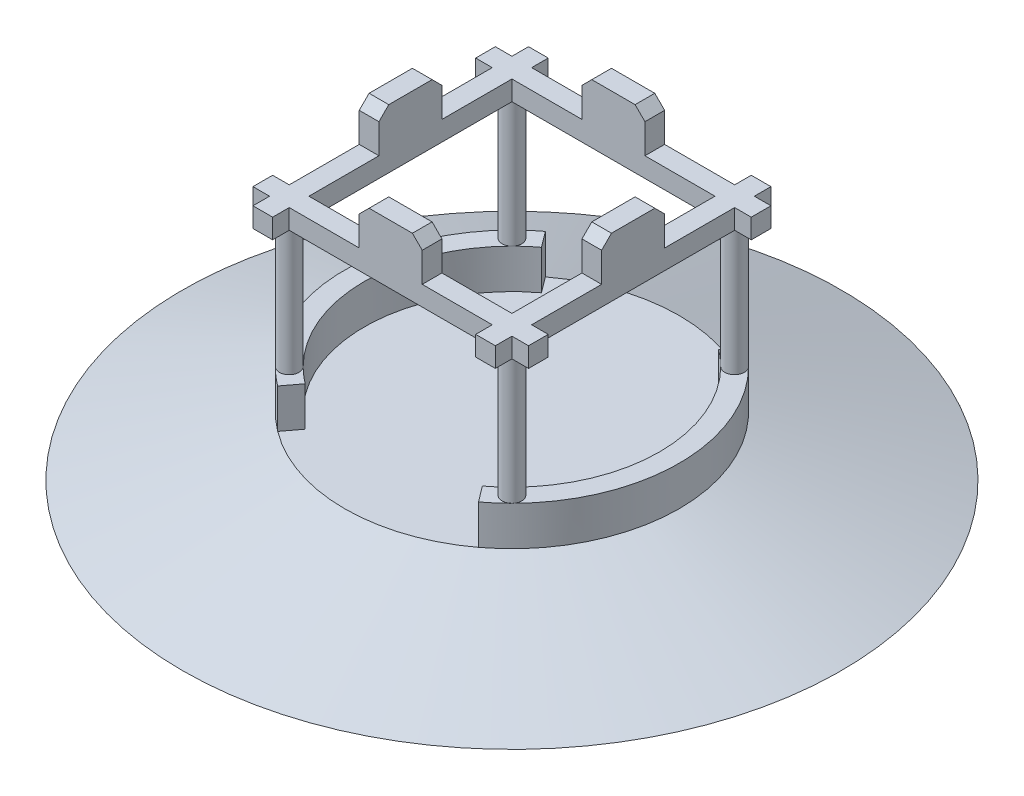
from build123d import *

# Parameters (mm, degrees)
EXTRUDE_1_DEPTH                      = 200
SKETCH_3_R                           = 50
EXTRUDE_2_DEPTH                      = 650
PATTERN_CIRCULAR_1_COUNT             = 4
SKETCH_4_W                           = 100
SKETCH_4_H                           = 1400
EXTRUDE_3_DEPTH                      = 100
SKETCH_5_W                           = 100
SKETCH_5_H                           = 320
EXTRUDE_4_DEPTH                      = 200
CHAMFER_1_SIZE                       = 50
PATTERN_CIRCULAR_2_COUNT             = 4
CHAMFER_1_OF_PATTERN_CIRCULAR_2_SIZE = 50


with BuildPart() as part:
    # Sketch 1 → Revolve 1 (revolve)
    with BuildSketch(Plane.XY, mode=Mode.PRIVATE) as revolve_1_sk:
        Polygon((0, 0), (-850, 0), (-1674.243225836, -300), (0, -300), align=None)
    revolve(revolve_1_sk.sketch.rotate(Axis((0, 105.15472523, 0), (0, -1, 0)), 270), axis=Axis((0, 105.15472523, 0), (0, -1, 0)))

    # Sketch 2 → Extrude 1 (add)
    with BuildSketch(Plane(origin=(0, 0, 0), x_dir=(1, 0, 0), z_dir=(0, 1, 0))):
        with BuildLine():
            ThreePointArc((-510, 680), (-850, 0), (-510, -680))
            Line((-510, -680), (-450, -600))
            ThreePointArc((-450, -600), (-750, 0), (-450, 600))
            Line((-450, 600), (-510, 680))
        make_face()
        with BuildLine():
            ThreePointArc((450, 600), (750, 0), (450, -600))
            Line((450, -600), (510, -680))
            ThreePointArc((510, -680), (760.26311235, -380.131556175), (850, 0))
            ThreePointArc((850, 0), (760.26311235, 380.131556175), (510, 680))
            Line((510, 680), (450, 600))
        make_face()
    extrude(amount=EXTRUDE_1_DEPTH)

    # Sketch 3 → Extrude 2 (add)
    with BuildSketch(Plane(origin=(0, 200, 0), x_dir=(1, 0, 0), z_dir=(0, 1, 0))):
        with Locations(Location((565.685424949, -565.685424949, 0), (0, 0, 135))):
            Circle(SKETCH_3_R)
    extrude_2 = extrude(amount=EXTRUDE_2_DEPTH)

    # Pattern Circular 1: Extrude 2 ×4 about axis
    pattern_circular_1_axis = Axis((0, 0, 0), (0, 1, 0))
    for i in range(1, PATTERN_CIRCULAR_1_COUNT):
        add(extrude_2.rotate(pattern_circular_1_axis, i * 360 / PATTERN_CIRCULAR_1_COUNT))

    # Sketch 4 → Extrude 3 (add)
    with BuildSketch(Plane(origin=(0, 850, 0), x_dir=(1, 0, 0), z_dir=(0, 1, 0))):
        with Locations((565.685424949, 0)):
            Rectangle(SKETCH_4_W, SKETCH_4_H)
    extrude_3 = extrude(amount=EXTRUDE_3_DEPTH)

    # Sketch 5 → Extrude 4 (add)
    with BuildSketch(Plane(origin=(0, 950, 0), x_dir=(1, 0, 0), z_dir=(0, 1, 0))):
        with Locations((565.685424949, 0)):
            Rectangle(SKETCH_5_W, SKETCH_5_H)
    extrude_4 = extrude(amount=EXTRUDE_4_DEPTH)

    # Chamfer 1
    chamfer_1_edges = [part.edges().sort_by_distance(p)[0] for p in [
        (565.685424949, 1150, -160),
        (565.685424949, 1150, 160),
    ]]
    chamfer(chamfer_1_edges, length=CHAMFER_1_SIZE)

    # Pattern Circular 2: Extrude 3, Extrude 4 ×4 about axis
    pattern_circular_2_axis = Axis((0, 0, 0), (0, 1, 0))
    add([extrude_3.rotate(pattern_circular_2_axis, i * 360 / PATTERN_CIRCULAR_2_COUNT) for i in range(1, PATTERN_CIRCULAR_2_COUNT)])
    add([extrude_4.rotate(pattern_circular_2_axis, i * 360 / PATTERN_CIRCULAR_2_COUNT) for i in range(1, PATTERN_CIRCULAR_2_COUNT)])

    # Chamfer 1 of Pattern Circular 2
    chamfer_1_of_pattern_circular_2_edges = [part.edges().sort_by_distance(p)[0] for p in [
        (-160, 1150, -565.685424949),
        (160, 1150, -565.685424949),
        (-565.685424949, 1150, 160),
        (-565.685424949, 1150, -160),
        (160, 1150, 565.685424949),
        (-160, 1150, 565.685424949),
    ]]
    chamfer(chamfer_1_of_pattern_circular_2_edges, length=CHAMFER_1_OF_PATTERN_CIRCULAR_2_SIZE)


solid = part.part
